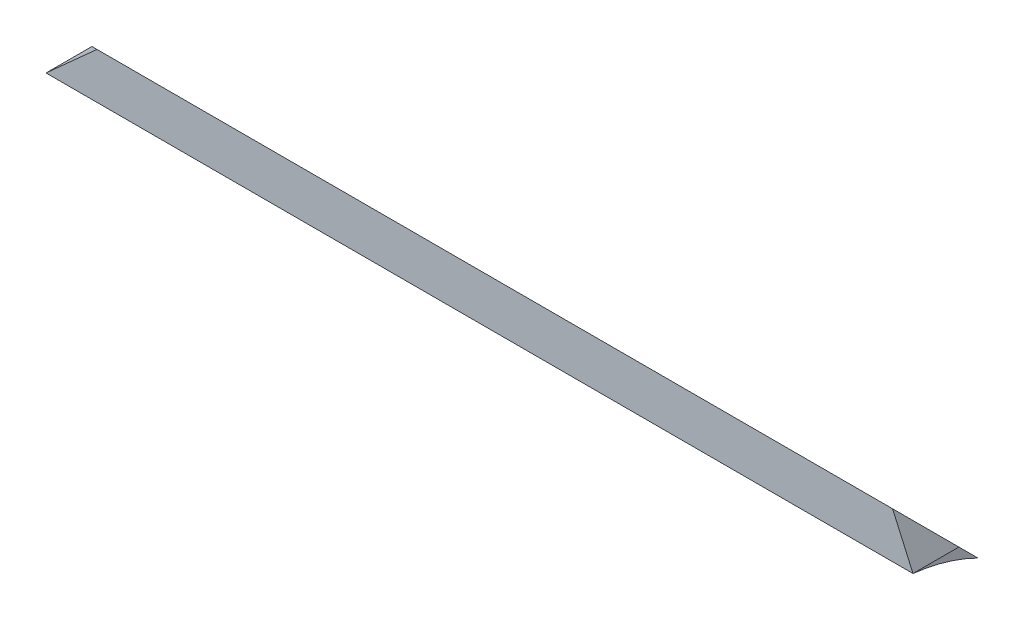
from build123d import *

# Parameters (mm, degrees)
SKETCH1_W          = 127
SKETCH1_H          = 12.7
EXTRUDE1_DEPTH     = 12.7
CUT_EXTRUDE1_DEPTH = 129.263712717
CUT_EXTRUDE2_DEPTH = 129.263712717
SKETCH5_OUTSIDE_W  = 154.542
SKETCH5_OUTSIDE_H  = 37.067
CUT_EXTRUDE7_DEPTH = 128.988341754


with BuildPart() as part:
    # Sketch1 → Extrude1 (new body)
    with BuildSketch(Plane(origin=(0, 0, 0), x_dir=(1, 0, 0), z_dir=(0, 1, 0))):
        with Locations((63.5, 6.35)):
            Rectangle(SKETCH1_W, SKETCH1_H)
    extrude(amount=EXTRUDE1_DEPTH)

    # Sketch2 → Cut-Extrude1 (cut, through all)
    with BuildSketch(Plane(origin=(127, 0, 0), x_dir=(0, 0, -1), z_dir=(1, 0, 0))):
        Polygon((0, 12.7), (12.7, 0), (12.7, 12.7), align=None)
    extrude(amount=-CUT_EXTRUDE1_DEPTH, mode=Mode.SUBTRACT)

    # Sketch3 → Cut-Extrude2 (cut, through all)
    with BuildSketch(Plane(origin=(127, 0, 0), x_dir=(0, 0, -1), z_dir=(1, 0, 0))):
        with BuildLine():
            Line((0, 2.977331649), (0, 22.108104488))
            Line((0, 22.108104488), (3.175, 22.108104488))
            Line((3.175, 22.108104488), (3.175, 2.800394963))
            ThreePointArc((3.175, 2.800394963), (-1.589963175, -54.128399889), (0, 2.977331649))
        make_face()
    extrude(amount=-CUT_EXTRUDE2_DEPTH, mode=Mode.SUBTRACT)

    # Sketch5 outside → Cut-Extrude7 (cut, through all)
    with BuildSketch(Plane.XY):
        with Locations((63.5, 4.7625)):
            Rectangle(SKETCH5_OUTSIDE_W, SKETCH5_OUTSIDE_H)
        Polygon((127, 0), (127, 2.800394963), (101.6, 59.950394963), (63.5, 59.950394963), (0, 2.800394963), (0, 0), align=None, mode=Mode.SUBTRACT)
    extrude(amount=-CUT_EXTRUDE7_DEPTH, mode=Mode.SUBTRACT)


solid = part.part
